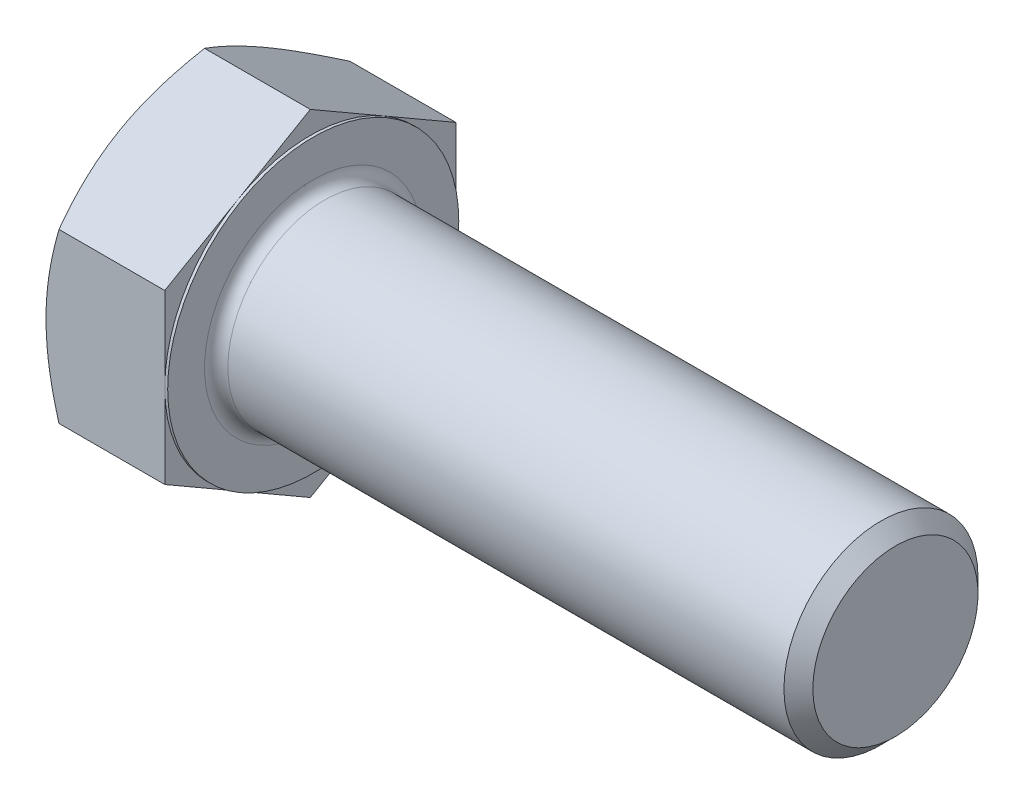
ISO-10303-21;
HEADER;
FILE_DESCRIPTION(('STEP AP214'),'2;1');
FILE_NAME('part.step','',(''),(''),'','','');
FILE_SCHEMA(('AUTOMOTIVE_DESIGN { 1 0 10303 214 1 1 1 1 }'));
ENDSEC;
DATA;
#1=APPLICATION_CONTEXT('core data for automotive mechanical design processes');
#2=APPLICATION_PROTOCOL_DEFINITION('international standard','automotive_design',2000,#1);
#3=PRODUCT_CONTEXT('',#1,'mechanical');
#4=PRODUCT('Part','Part','',(#3));
#5=PRODUCT_RELATED_PRODUCT_CATEGORY('part','',(#4));
#6=PRODUCT_DEFINITION_FORMATION('','',#4);
#7=PRODUCT_DEFINITION_CONTEXT('part definition',#1,'design');
#8=PRODUCT_DEFINITION('design','',#6,#7);
#9=PRODUCT_DEFINITION_SHAPE('','',#8);
#10=(LENGTH_UNIT() NAMED_UNIT(*) SI_UNIT(.MILLI.,.METRE.));
#11=(NAMED_UNIT(*) PLANE_ANGLE_UNIT() SI_UNIT($,.RADIAN.));
#12=(NAMED_UNIT(*) SI_UNIT($,.STERADIAN.) SOLID_ANGLE_UNIT());
#13=UNCERTAINTY_MEASURE_WITH_UNIT(LENGTH_MEASURE(1.E-05),#10,'distance_accuracy_value','');
#14=(GEOMETRIC_REPRESENTATION_CONTEXT(3) GLOBAL_UNCERTAINTY_ASSIGNED_CONTEXT((#13)) GLOBAL_UNIT_ASSIGNED_CONTEXT((#10,
#11,#12)) REPRESENTATION_CONTEXT('',''));
#15=CARTESIAN_POINT('',(0.,0.,0.));
#16=DIRECTION('',(0.,0.,1.));
#17=DIRECTION('',(1.,0.,0.));
#18=AXIS2_PLACEMENT_3D('',#15,#16,#17);
#19=CARTESIAN_POINT('',(15.9258,21.9970452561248,0.));
#20=DIRECTION('',(1.,0.,0.));
#21=DIRECTION('',(0.,0.,-1.));
#22=AXIS2_PLACEMENT_3D('',#19,#20,#21);
#23=PLANE('',#22);
#24=CARTESIAN_POINT('',(15.9258,0.,0.));
#25=DIRECTION('',(1.,0.,0.));
#26=DIRECTION('',(0.,0.,-1.));
#27=AXIS2_PLACEMENT_3D('',#24,#25,#26);
#28=CIRCLE('',#27,14.224);
#29=CARTESIAN_POINT('',(15.9258,0.,-14.224));
#30=VERTEX_POINT('',#29);
#31=EDGE_CURVE('E41',#30,#30,#28,.F.);
#32=ORIENTED_EDGE('',*,*,#31,.T.);
#33=EDGE_LOOP('',(#32));
#34=FACE_BOUND('',#33,.T.);
#35=CARTESIAN_POINT('',(15.9258,0.,0.));
#36=DIRECTION('',(1.,0.,0.));
#37=DIRECTION('',(0.,0.,-1.));
#38=AXIS2_PLACEMENT_3D('',#35,#36,#37);
#39=CIRCLE('',#38,19.05);
#40=CARTESIAN_POINT('',(15.9258,0.,-19.05));
#41=VERTEX_POINT('',#40);
#42=EDGE_CURVE('E298',#41,#41,#39,.T.);
#43=ORIENTED_EDGE('',*,*,#42,.T.);
#44=EDGE_LOOP('',(#43));
#45=FACE_BOUND('',#44,.T.);
#46=ADVANCED_FACE('F33',(#34,#45),#23,.T.);
#47=CARTESIAN_POINT('',(0.,0.,0.));
#48=DIRECTION('',(-1.,0.,0.));
#49=DIRECTION('',(0.,0.,1.));
#50=AXIS2_PLACEMENT_3D('',#47,#48,#49);
#51=CYLINDRICAL_SURFACE('',#50,12.7);
#52=CARTESIAN_POINT('',(17.4498,0.,0.));
#53=DIRECTION('',(1.,0.,0.));
#54=DIRECTION('',(0.,0.,-1.));
#55=AXIS2_PLACEMENT_3D('',#52,#53,#54);
#56=CIRCLE('',#55,12.7);
#57=CARTESIAN_POINT('',(17.4498,0.,-12.7));
#58=VERTEX_POINT('',#57);
#59=EDGE_CURVE('E11',#58,#58,#56,.T.);
#60=ORIENTED_EDGE('',*,*,#59,.T.);
#61=EDGE_LOOP('',(#60));
#62=FACE_BOUND('',#61,.T.);
#63=CARTESIAN_POINT('',(90.2335,0.,0.));
#64=DIRECTION('',(-1.,0.,0.));
#65=DIRECTION('',(0.,0.,1.));
#66=AXIS2_PLACEMENT_3D('',#63,#64,#65);
#67=CIRCLE('',#66,12.7);
#68=CARTESIAN_POINT('',(90.2335,0.,12.7));
#69=VERTEX_POINT('',#68);
#70=EDGE_CURVE('E277',#69,#69,#67,.T.);
#71=ORIENTED_EDGE('',*,*,#70,.T.);
#72=EDGE_LOOP('',(#71));
#73=FACE_BOUND('',#72,.T.);
#74=ADVANCED_FACE('F251',(#62,#73),#51,.T.);
#75=CARTESIAN_POINT('',(92.1258,0.,0.));
#76=DIRECTION('',(-1.,0.,0.));
#77=DIRECTION('',(0.,0.,1.));
#78=AXIS2_PLACEMENT_3D('',#75,#76,#77);
#79=CONICAL_SURFACE('',#78,10.8077,0.785398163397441);
#80=ORIENTED_EDGE('',*,*,#70,.F.);
#81=EDGE_LOOP('',(#80));
#82=FACE_BOUND('',#81,.T.);
#83=CARTESIAN_POINT('',(92.1258,0.,0.));
#84=DIRECTION('',(-1.,0.,0.));
#85=DIRECTION('',(0.,0.,1.));
#86=AXIS2_PLACEMENT_3D('',#83,#84,#85);
#87=CIRCLE('',#86,10.8077);
#88=CARTESIAN_POINT('',(92.1258,0.,10.8077));
#89=VERTEX_POINT('',#88);
#90=EDGE_CURVE('E275',#89,#89,#87,.T.);
#91=ORIENTED_EDGE('',*,*,#90,.T.);
#92=EDGE_LOOP('',(#91));
#93=FACE_BOUND('',#92,.T.);
#94=ADVANCED_FACE('F256',(#82,#93),#79,.T.);
#95=CARTESIAN_POINT('',(92.1258,0.,0.));
#96=DIRECTION('',(-1.,0.,0.));
#97=DIRECTION('',(0.,0.,1.));
#98=AXIS2_PLACEMENT_3D('',#95,#96,#97);
#99=PLANE('',#98);
#100=ORIENTED_EDGE('',*,*,#90,.F.);
#101=EDGE_LOOP('',(#100));
#102=FACE_BOUND('',#101,.T.);
#103=ADVANCED_FACE('F263',(#102),#99,.F.);
#104=CARTESIAN_POINT('',(15.5448,19.05,0.));
#105=DIRECTION('',(1.,0.,0.));
#106=DIRECTION('',(0.,0.,-1.));
#107=AXIS2_PLACEMENT_3D('',#104,#105,#106);
#108=PLANE('',#107);
#109=DIRECTION('',(0.,0.500000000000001,0.866025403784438));
#110=VECTOR('',#109,1.);
#111=CARTESIAN_POINT('',(15.5448,10.9985226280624,-19.05));
#112=LINE('',#111,#110);
#113=CARTESIAN_POINT('',(15.5448,10.9985226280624,-19.05));
#114=VERTEX_POINT('',#113);
#115=CARTESIAN_POINT('',(15.5448,16.4977839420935,-9.52500000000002));
#116=VERTEX_POINT('',#115);
#117=EDGE_CURVE('E165',#114,#116,#112,.T.);
#118=ORIENTED_EDGE('',*,*,#117,.T.);
#119=CARTESIAN_POINT('',(15.5448,0.,0.));
#120=DIRECTION('',(-1.,0.,0.));
#121=DIRECTION('',(0.,0.,1.));
#122=AXIS2_PLACEMENT_3D('',#119,#120,#121);
#123=CIRCLE('',#122,19.05);
#124=CARTESIAN_POINT('',(15.5448,0.,-19.05));
#125=VERTEX_POINT('',#124);
#126=EDGE_CURVE('E48',#116,#125,#123,.T.);
#127=ORIENTED_EDGE('',*,*,#126,.T.);
#128=DIRECTION('',(0.,1.,0.));
#129=VECTOR('',#128,1.);
#130=CARTESIAN_POINT('',(15.5448,10.9985226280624,-19.05));
#131=LINE('',#130,#129);
#132=EDGE_CURVE('E301',#125,#114,#131,.T.);
#133=ORIENTED_EDGE('',*,*,#132,.T.);
#134=EDGE_LOOP('',(#118,#127,#133));
#135=FACE_BOUND('',#134,.T.);
#136=ADVANCED_FACE('F266',(#135),#108,.T.);
#137=CARTESIAN_POINT('',(15.5448,21.9970452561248,0.));
#138=VERTEX_POINT('',#137);
#139=EDGE_CURVE('E163',#116,#138,#112,.T.);
#140=ORIENTED_EDGE('',*,*,#139,.T.);
#141=DIRECTION('',(0.,-0.500000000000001,0.866025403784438));
#142=VECTOR('',#141,1.);
#143=CARTESIAN_POINT('',(15.5448,21.9970452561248,0.));
#144=LINE('',#143,#142);
#145=CARTESIAN_POINT('',(15.5448,16.4977839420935,9.52500000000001));
#146=VERTEX_POINT('',#145);
#147=EDGE_CURVE('E162',#138,#146,#144,.T.);
#148=ORIENTED_EDGE('',*,*,#147,.T.);
#149=EDGE_CURVE('E151',#146,#116,#123,.T.);
#150=ORIENTED_EDGE('',*,*,#149,.T.);
#151=EDGE_LOOP('',(#140,#148,#150));
#152=FACE_BOUND('',#151,.T.);
#153=ADVANCED_FACE('F271',(#152),#108,.T.);
#154=CARTESIAN_POINT('',(15.5448,10.9985226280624,19.05));
#155=VERTEX_POINT('',#154);
#156=EDGE_CURVE('E130',#146,#155,#144,.T.);
#157=ORIENTED_EDGE('',*,*,#156,.T.);
#158=DIRECTION('',(0.,-1.,0.));
#159=VECTOR('',#158,1.);
#160=CARTESIAN_POINT('',(15.5448,10.9985226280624,19.05));
#161=LINE('',#160,#159);
#162=CARTESIAN_POINT('',(15.5448,0.,19.05));
#163=VERTEX_POINT('',#162);
#164=EDGE_CURVE('E124',#155,#163,#161,.T.);
#165=ORIENTED_EDGE('',*,*,#164,.T.);
#166=EDGE_CURVE('E128',#163,#146,#123,.T.);
#167=ORIENTED_EDGE('',*,*,#166,.T.);
#168=EDGE_LOOP('',(#157,#165,#167));
#169=FACE_BOUND('',#168,.T.);
#170=ADVANCED_FACE('F126',(#169),#108,.T.);
#171=CARTESIAN_POINT('',(15.5448,-10.9985226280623,19.05));
#172=VERTEX_POINT('',#171);
#173=EDGE_CURVE('E134',#163,#172,#161,.T.);
#174=ORIENTED_EDGE('',*,*,#173,.T.);
#175=DIRECTION('',(0.,-0.500000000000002,-0.866025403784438));
#176=VECTOR('',#175,1.);
#177=CARTESIAN_POINT('',(15.5448,-21.9970452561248,0.));
#178=LINE('',#177,#176);
#179=CARTESIAN_POINT('',(15.5448,-16.4977839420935,9.52500000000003));
#180=VERTEX_POINT('',#179);
#181=EDGE_CURVE('E141',#172,#180,#178,.T.);
#182=ORIENTED_EDGE('',*,*,#181,.T.);
#183=EDGE_CURVE('E138',#180,#163,#123,.T.);
#184=ORIENTED_EDGE('',*,*,#183,.T.);
#185=EDGE_LOOP('',(#174,#182,#184));
#186=FACE_BOUND('',#185,.T.);
#187=ADVANCED_FACE('F139',(#186),#108,.T.);
#188=CARTESIAN_POINT('',(15.5448,-21.9970452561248,0.));
#189=VERTEX_POINT('',#188);
#190=EDGE_CURVE('E157',#180,#189,#178,.T.);
#191=ORIENTED_EDGE('',*,*,#190,.T.);
#192=DIRECTION('',(0.,0.5,-0.866025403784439));
#193=VECTOR('',#192,1.);
#194=CARTESIAN_POINT('',(15.5448,-10.9985226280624,-19.05));
#195=LINE('',#194,#193);
#196=CARTESIAN_POINT('',(15.5448,-16.4977839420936,-9.525));
#197=VERTEX_POINT('',#196);
#198=EDGE_CURVE('E339',#189,#197,#195,.T.);
#199=ORIENTED_EDGE('',*,*,#198,.T.);
#200=EDGE_CURVE('E145',#197,#180,#123,.T.);
#201=ORIENTED_EDGE('',*,*,#200,.T.);
#202=EDGE_LOOP('',(#191,#199,#201));
#203=FACE_BOUND('',#202,.T.);
#204=ADVANCED_FACE('F340',(#203),#108,.T.);
#205=CARTESIAN_POINT('',(15.5448,-10.9985226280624,-19.05));
#206=VERTEX_POINT('',#205);
#207=EDGE_CURVE('E152',#197,#206,#195,.T.);
#208=ORIENTED_EDGE('',*,*,#207,.T.);
#209=EDGE_CURVE('E302',#206,#125,#131,.T.);
#210=ORIENTED_EDGE('',*,*,#209,.T.);
#211=EDGE_CURVE('E309',#125,#197,#123,.T.);
#212=ORIENTED_EDGE('',*,*,#211,.T.);
#213=EDGE_LOOP('',(#208,#210,#212));
#214=FACE_BOUND('',#213,.T.);
#215=ADVANCED_FACE('F272',(#214),#108,.T.);
#216=CARTESIAN_POINT('',(0.,0.,0.));
#217=DIRECTION('',(-1.,0.,0.));
#218=DIRECTION('',(0.,0.,1.));
#219=AXIS2_PLACEMENT_3D('',#216,#217,#218);
#220=CYLINDRICAL_SURFACE('',#219,19.05);
#221=ORIENTED_EDGE('',*,*,#126,.F.);
#222=ORIENTED_EDGE('',*,*,#149,.F.);
#223=ORIENTED_EDGE('',*,*,#166,.F.);
#224=ORIENTED_EDGE('',*,*,#183,.F.);
#225=ORIENTED_EDGE('',*,*,#200,.F.);
#226=ORIENTED_EDGE('',*,*,#211,.F.);
#227=EDGE_LOOP('',(#221,#222,#223,#224,#225,#226));
#228=FACE_BOUND('',#227,.T.);
#229=ORIENTED_EDGE('',*,*,#42,.F.);
#230=EDGE_LOOP('',(#229));
#231=FACE_BOUND('',#230,.T.);
#232=ADVANCED_FACE('F148',(#228,#231),#220,.T.);
#233=CARTESIAN_POINT('',(0.,21.9970452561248,0.));
#234=DIRECTION('',(1.,0.,0.));
#235=DIRECTION('',(0.,0.,-1.));
#236=AXIS2_PLACEMENT_3D('',#233,#234,#235);
#237=PLANE('',#236);
#238=CARTESIAN_POINT('',(0.,0.,0.));
#239=DIRECTION('',(1.,0.,0.));
#240=DIRECTION('',(0.,0.,-1.));
#241=AXIS2_PLACEMENT_3D('',#238,#239,#240);
#242=CIRCLE('',#241,19.05);
#243=CARTESIAN_POINT('',(0.,0.,-19.05));
#244=VERTEX_POINT('',#243);
#245=CARTESIAN_POINT('',(0.,16.4977839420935,-9.52500000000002));
#246=VERTEX_POINT('',#245);
#247=EDGE_CURVE('E297',#244,#246,#242,.T.);
#248=ORIENTED_EDGE('',*,*,#247,.F.);
#249=CARTESIAN_POINT('',(0.,-16.4977839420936,-9.525));
#250=VERTEX_POINT('',#249);
#251=EDGE_CURVE('E293',#250,#244,#242,.T.);
#252=ORIENTED_EDGE('',*,*,#251,.F.);
#253=CARTESIAN_POINT('',(0.,-16.4977839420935,9.52500000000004));
#254=VERTEX_POINT('',#253);
#255=EDGE_CURVE('E296',#254,#250,#242,.T.);
#256=ORIENTED_EDGE('',*,*,#255,.F.);
#257=CARTESIAN_POINT('',(0.,0.,19.05));
#258=VERTEX_POINT('',#257);
#259=EDGE_CURVE('E332',#258,#254,#242,.T.);
#260=ORIENTED_EDGE('',*,*,#259,.F.);
#261=CARTESIAN_POINT('',(0.,0.,0.));
#262=DIRECTION('',(-1.,0.,0.));
#263=DIRECTION('',(0.,0.,1.));
#264=AXIS2_PLACEMENT_3D('',#261,#262,#263);
#265=CIRCLE('',#264,19.05);
#266=CARTESIAN_POINT('',(0.,16.4977839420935,9.52500000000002));
#267=VERTEX_POINT('',#266);
#268=EDGE_CURVE('E166',#258,#267,#265,.T.);
#269=ORIENTED_EDGE('',*,*,#268,.T.);
#270=EDGE_CURVE('E355',#246,#267,#242,.T.);
#271=ORIENTED_EDGE('',*,*,#270,.F.);
#272=EDGE_LOOP('',(#248,#252,#256,#260,#269,#271));
#273=FACE_BOUND('',#272,.T.);
#274=ADVANCED_FACE('F197',(#273),#237,.F.);
#275=CARTESIAN_POINT('',(0.,0.,0.));
#276=DIRECTION('',(1.,0.,0.));
#277=DIRECTION('',(0.,0.,-1.));
#278=AXIS2_PLACEMENT_3D('',#275,#276,#277);
#279=CONICAL_SURFACE('',#278,19.05,1.0471975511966);
#280=CARTESIAN_POINT('',(1.70154403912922,10.9984071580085,19.0502));
#281=CARTESIAN_POINT('',(1.56198341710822,11.2401500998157,18.6314889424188));
#282=CARTESIAN_POINT('',(1.42875584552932,11.4828359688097,18.2111446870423));
#283=CARTESIAN_POINT('',(1.17672716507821,11.9701537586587,17.3670855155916));
#284=CARTESIAN_POINT('',(1.05793080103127,12.2147862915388,16.9433695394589));
#285=CARTESIAN_POINT('',(0.836361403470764,12.7064702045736,16.0917480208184));
#286=CARTESIAN_POINT('',(0.733626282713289,12.9535258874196,15.6638350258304));
#287=CARTESIAN_POINT('',(0.546385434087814,13.4493539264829,14.8050356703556));
#288=CARTESIAN_POINT('',(0.461878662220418,13.6981261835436,14.374149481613));
#289=CARTESIAN_POINT('',(0.314688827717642,14.1910129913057,13.5204444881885));
#290=CARTESIAN_POINT('',(0.251518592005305,14.4350909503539,13.0976890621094));
#291=CARTESIAN_POINT('',(0.145596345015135,14.9243652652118,12.250241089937));
#292=CARTESIAN_POINT('',(0.102844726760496,15.1695616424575,11.8255485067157));
#293=CARTESIAN_POINT('',(0.0388391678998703,15.6603662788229,10.9754499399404));
#294=CARTESIAN_POINT('',(0.0175596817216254,15.9059736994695,10.5500454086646));
#295=CARTESIAN_POINT('',(-0.00304398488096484,16.397415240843,9.69884369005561));
#296=CARTESIAN_POINT('',(-0.00236884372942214,16.6432493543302,9.27304651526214));
#297=CARTESIAN_POINT('',(0.0194033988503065,17.1028414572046,8.47700964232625));
#298=CARTESIAN_POINT('',(0.0378455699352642,17.316632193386,8.10671322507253));
#299=CARTESIAN_POINT('',(0.0909844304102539,17.7437036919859,7.36700369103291));
#300=CARTESIAN_POINT('',(0.125680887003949,17.9569844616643,6.9975905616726));
#301=CARTESIAN_POINT('',(0.210726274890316,18.3829552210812,6.25978756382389));
#302=CARTESIAN_POINT('',(0.261089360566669,18.5956445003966,5.89139892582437));
#303=CARTESIAN_POINT('',(0.376579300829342,19.0200105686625,5.15637533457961));
#304=CARTESIAN_POINT('',(0.441706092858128,19.2316873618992,4.78974037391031));
#305=CARTESIAN_POINT('',(0.660888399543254,19.8742595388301,3.6767727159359));
#306=CARTESIAN_POINT('',(0.836799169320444,20.3032941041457,2.93366305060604));
#307=CARTESIAN_POINT('',(1.23604434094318,21.1549659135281,1.45852420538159));
#308=CARTESIAN_POINT('',(1.45928498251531,21.5776140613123,0.726476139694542));
#309=CARTESIAN_POINT('',(1.70154403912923,21.9971607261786,-0.000199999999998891));
#310=B_SPLINE_CURVE_WITH_KNOTS('',3,(#280,#281,#282,#283,#284,#285,#286,#287,#288,#289,#290,
#291,#292,#293,#294,#295,#296,#297,#298,#299,#300,#301,#302,#303,#304,#305,#306,#307,#308,#309),
.UNSPECIFIED.,.F.,.F.,(4,2,2,2,2,2,2,2,2,2,2,2,2,2,4),(0.,1.50971559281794,3.01992622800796,
4.53364959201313,6.04728623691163,7.52356313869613,8.99986845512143,10.4744153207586,
11.9489166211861,13.2325441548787,14.5161533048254,15.8009255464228,17.085692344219,
19.7118183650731,22.3327898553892),.UNSPECIFIED.);
#311=CARTESIAN_POINT('',(1.70147737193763,21.9970452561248,0.));
#312=VERTEX_POINT('',#311);
#313=EDGE_CURVE('E217',#267,#312,#310,.T.);
#314=ORIENTED_EDGE('',*,*,#313,.T.);
#315=CARTESIAN_POINT('',(1.70154403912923,21.9971607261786,0.000200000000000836));
#316=CARTESIAN_POINT('',(1.56198341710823,21.7554177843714,-0.41851105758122));
#317=CARTESIAN_POINT('',(1.42875584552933,21.5127319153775,-0.838855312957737));
#318=CARTESIAN_POINT('',(1.17672716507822,21.0254141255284,-1.68291448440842));
#319=CARTESIAN_POINT('',(1.05793080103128,20.7807815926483,-2.10663046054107));
#320=CARTESIAN_POINT('',(0.836361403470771,20.2890976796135,-2.95825197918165));
#321=CARTESIAN_POINT('',(0.733626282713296,20.0420419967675,-3.38616497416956));
#322=CARTESIAN_POINT('',(0.546385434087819,19.5462139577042,-4.24496432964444));
#323=CARTESIAN_POINT('',(0.461878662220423,19.2974417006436,-4.67585051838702));
#324=CARTESIAN_POINT('',(0.314688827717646,18.8045548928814,-5.5295555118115));
#325=CARTESIAN_POINT('',(0.251518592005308,18.5604769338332,-5.95231093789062));
#326=CARTESIAN_POINT('',(0.145596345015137,18.0712026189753,-6.79975891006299));
#327=CARTESIAN_POINT('',(0.102844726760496,17.8260062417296,-7.22445149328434));
#328=CARTESIAN_POINT('',(0.0388391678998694,17.3352016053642,-8.07455006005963));
#329=CARTESIAN_POINT('',(0.0175596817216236,17.0895941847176,-8.49995459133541));
#330=CARTESIAN_POINT('',(-0.003043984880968,16.5981526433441,-9.3511563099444));
#331=CARTESIAN_POINT('',(-0.00236884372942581,16.3523185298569,-9.77695348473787));
#332=CARTESIAN_POINT('',(0.0194033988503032,15.8927264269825,-10.5729903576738));
#333=CARTESIAN_POINT('',(0.0378455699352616,15.6789356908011,-10.9432867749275));
#334=CARTESIAN_POINT('',(0.0909844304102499,15.2518641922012,-11.6829963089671));
#335=CARTESIAN_POINT('',(0.125680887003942,15.0385834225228,-12.0524094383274));
#336=CARTESIAN_POINT('',(0.210726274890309,14.612612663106,-12.7902124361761));
#337=CARTESIAN_POINT('',(0.261089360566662,14.3999233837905,-13.1586010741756));
#338=CARTESIAN_POINT('',(0.376579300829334,13.9755573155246,-13.8936246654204));
#339=CARTESIAN_POINT('',(0.441706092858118,13.7638805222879,-14.2602596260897));
#340=CARTESIAN_POINT('',(0.660888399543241,13.121308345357,-15.3732272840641));
#341=CARTESIAN_POINT('',(0.836799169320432,12.6922737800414,-16.116336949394));
#342=CARTESIAN_POINT('',(1.23604434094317,11.840601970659,-17.5914757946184));
#343=CARTESIAN_POINT('',(1.4592849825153,11.4179538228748,-18.3235238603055));
#344=CARTESIAN_POINT('',(1.70154403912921,10.9984071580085,-19.0502));
#345=B_SPLINE_CURVE_WITH_KNOTS('',3,(#315,#316,#317,#318,#319,#320,#321,#322,#323,#324,#325,
#326,#327,#328,#329,#330,#331,#332,#333,#334,#335,#336,#337,#338,#339,#340,#341,#342,#343,#344),
.UNSPECIFIED.,.F.,.F.,(4,2,2,2,2,2,2,2,2,2,2,2,2,2,4),(0.,1.50971559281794,3.01992622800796,
4.53364959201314,6.04728623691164,7.52356313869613,8.99986845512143,10.4744153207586,
11.9489166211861,13.2325441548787,14.5161533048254,15.8009255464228,17.085692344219,
19.7118183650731,22.3327898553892),.UNSPECIFIED.);
#346=EDGE_CURVE('E56',#312,#246,#345,.T.);
#347=ORIENTED_EDGE('',*,*,#346,.T.);
#348=ORIENTED_EDGE('',*,*,#270,.T.);
#349=EDGE_LOOP('',(#314,#347,#348));
#350=FACE_BOUND('',#349,.T.);
#351=ADVANCED_FACE('F356',(#350),#279,.T.);
#352=CARTESIAN_POINT('',(9.36387045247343,-29.681284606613,19.05));
#353=CARTESIAN_POINT('',(9.16146582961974,-29.264706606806,19.05));
#354=CARTESIAN_POINT('',(8.96006010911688,-28.8476434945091,19.05));
#355=CARTESIAN_POINT('',(8.55947242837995,-28.0124458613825,19.05));
#356=CARTESIAN_POINT('',(8.36029049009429,-27.5943113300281,19.05));
#357=CARTESIAN_POINT('',(7.7663676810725,-26.3380393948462,19.05));
#358=CARTESIAN_POINT('',(7.37530881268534,-25.498154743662,19.05));
#359=CARTESIAN_POINT('',(6.60327220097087,-23.808305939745,19.05));
#360=CARTESIAN_POINT('',(6.22235974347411,-22.9583118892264,19.05));
#361=CARTESIAN_POINT('',(5.47593301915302,-21.2516124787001,19.05));
#362=CARTESIAN_POINT('',(5.11041803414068,-20.3949074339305,19.05));
#363=CARTESIAN_POINT('',(4.38719116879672,-18.6452025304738,19.05));
#364=CARTESIAN_POINT('',(4.03012757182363,-17.7519333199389,19.05));
#365=CARTESIAN_POINT('',(3.34269044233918,-15.9549889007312,19.05));
#366=CARTESIAN_POINT('',(3.01231988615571,-15.0513125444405,19.05));
#367=CARTESIAN_POINT('',(2.38684616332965,-13.2337927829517,19.05));
#368=CARTESIAN_POINT('',(2.09167277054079,-12.3199737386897,19.05));
#369=CARTESIAN_POINT('',(1.54595671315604,-10.4791413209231,19.05));
#370=CARTESIAN_POINT('',(1.29540013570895,-9.55213215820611,19.05));
#371=CARTESIAN_POINT('',(0.962715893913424,-8.15413474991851,19.05));
#372=CARTESIAN_POINT('',(0.859241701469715,-7.68819648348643,19.05));
#373=CARTESIAN_POINT('',(0.667894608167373,-6.75311076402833,19.05));
#374=CARTESIAN_POINT('',(0.580021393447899,-6.28396337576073,19.05));
#375=CARTESIAN_POINT('',(0.421420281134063,-5.34278179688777,19.05));
#376=CARTESIAN_POINT('',(0.350691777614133,-4.87074770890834,19.05));
#377=CARTESIAN_POINT('',(0.227781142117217,-3.92425443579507,19.05));
#378=CARTESIAN_POINT('',(0.175598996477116,-3.44979525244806,19.05));
#379=CARTESIAN_POINT('',(0.091484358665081,-2.50539642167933,19.05));
#380=CARTESIAN_POINT('',(0.0592932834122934,-2.03547994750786,19.05));
#381=CARTESIAN_POINT('',(0.0148196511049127,-1.09470720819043,19.05));
#382=CARTESIAN_POINT('',(0.00253675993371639,-0.623850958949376,19.05));
#383=CARTESIAN_POINT('',(-0.00182781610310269,0.317959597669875,19.05));
#384=CARTESIAN_POINT('',(0.00609054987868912,0.788913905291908,19.05));
#385=CARTESIAN_POINT('',(0.0419336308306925,1.73006593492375,19.05));
#386=CARTESIAN_POINT('',(0.0698592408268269,2.20026362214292,19.05));
#387=CARTESIAN_POINT('',(0.160085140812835,3.32615149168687,19.05));
#388=CARTESIAN_POINT('',(0.231647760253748,3.9811127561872,19.05));
#389=CARTESIAN_POINT('',(0.409728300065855,5.2862687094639,19.05));
#390=CARTESIAN_POINT('',(0.516250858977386,5.93646275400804,19.05));
#391=CARTESIAN_POINT('',(0.760462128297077,7.23143263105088,19.05));
#392=CARTESIAN_POINT('',(0.898174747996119,7.87620391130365,19.05));
#393=CARTESIAN_POINT('',(1.20055584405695,9.159324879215,19.05));
#394=CARTESIAN_POINT('',(1.36522394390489,9.79767465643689,19.05));
#395=CARTESIAN_POINT('',(1.7214113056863,11.0820581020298,19.05));
#396=CARTESIAN_POINT('',(1.91344522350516,11.7279480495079,19.05));
#397=CARTESIAN_POINT('',(2.31762854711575,13.0133672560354,19.05));
#398=CARTESIAN_POINT('',(2.52977808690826,13.6528964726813,19.05));
#399=CARTESIAN_POINT('',(2.97080026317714,14.9259053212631,19.05));
#400=CARTESIAN_POINT('',(3.19966751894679,15.5593868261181,19.05));
#401=CARTESIAN_POINT('',(3.67140574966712,16.8210826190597,19.05));
#402=CARTESIAN_POINT('',(3.91427655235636,17.4492969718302,19.05));
#403=CARTESIAN_POINT('',(4.50783243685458,18.9429543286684,19.05));
#404=CARTESIAN_POINT('',(4.86391009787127,19.8062512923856,19.05));
#405=CARTESIAN_POINT('',(5.59369975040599,21.5253820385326,19.05));
#406=CARTESIAN_POINT('',(5.96741288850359,22.3812153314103,19.05));
#407=CARTESIAN_POINT('',(6.72890710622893,24.0868250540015,19.05));
#408=CARTESIAN_POINT('',(7.11669148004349,24.9366000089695,19.05));
#409=CARTESIAN_POINT('',(7.90345923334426,26.63091294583,19.05));
#410=CARTESIAN_POINT('',(8.3024423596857,27.4754510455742,19.05));
#411=CARTESIAN_POINT('',(9.10995217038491,29.161125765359,19.05));
#412=CARTESIAN_POINT('',(9.5184891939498,30.0022574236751,19.05));
#413=CARTESIAN_POINT('',(10.3430229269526,31.6808559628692,19.05));
#414=CARTESIAN_POINT('',(10.7590196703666,32.518322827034,19.05));
#415=CARTESIAN_POINT('',(11.5971269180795,34.1900490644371,19.05));
#416=CARTESIAN_POINT('',(12.0192366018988,35.0243088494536,19.05));
#417=CARTESIAN_POINT('',(12.8686125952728,36.6901944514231,19.05));
#418=CARTESIAN_POINT('',(13.2958788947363,37.5218202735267,19.05));
#419=CARTESIAN_POINT('',(14.510917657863,39.8716762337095,19.05));
#420=CARTESIAN_POINT('',(15.3037675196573,41.3872809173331,19.05));
#421=CARTESIAN_POINT('',(16.9002701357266,44.4128482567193,19.05));
#422=CARTESIAN_POINT('',(17.7039232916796,45.9228107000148,19.05));
#423=CARTESIAN_POINT('',(19.3174048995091,48.9344252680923,19.05));
#424=CARTESIAN_POINT('',(20.1272121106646,50.4360887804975,19.05));
#425=CARTESIAN_POINT('',(21.3467150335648,52.6859282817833,19.05));
#426=CARTESIAN_POINT('',(21.7540032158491,53.4354111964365,19.05));
#427=CARTESIAN_POINT('',(22.5700166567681,54.9335928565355,19.05));
#428=CARTESIAN_POINT('',(22.9787419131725,55.6822916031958,19.05));
#429=CARTESIAN_POINT('',(23.3881024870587,56.4306429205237,19.05));
#430=B_SPLINE_CURVE_WITH_KNOTS('',3,(#352,#353,#354,#355,#356,#357,#358,#359,#360,#361,#362,
#363,#364,#365,#366,#367,#368,#369,#370,#371,#372,#373,#374,#375,#376,#377,#378,#379,#380,#381,
#382,#383,#384,#385,#386,#387,#388,#389,#390,#391,#392,#393,#394,#395,#396,#397,#398,#399,#400,
#401,#402,#403,#404,#405,#406,#407,#408,#409,#410,#411,#412,#413,#414,#415,#416,#417,#418,#419,
#420,#421,#422,#423,#424,#425,#426,#427,#428,#429),.UNSPECIFIED.,.F.,.F.,(4,2,2,2,2,2,2,2,2,2,2,
2,2,2,2,2,2,2,2,2,2,2,2,2,2,2,2,2,2,2,2,2,2,2,2,2,2,2,4),(0.,1.38943761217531,2.77888892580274,
5.55819563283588,8.35240254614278,11.1464789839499,14.0321224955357,16.9180873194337,
19.7981940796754,22.6774011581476,24.1090510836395,25.5406722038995,26.9722427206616,
28.4038121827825,29.8164561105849,31.2290763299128,32.6417001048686,34.0543870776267,
36.0298747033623,38.0056245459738,39.9828940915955,41.9601360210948,43.9812438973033,
46.0023652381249,48.0228389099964,50.0432877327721,52.8445655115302,55.6460256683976,
58.4481459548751,61.2502029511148,64.0554471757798,66.8607041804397,69.665588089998,
72.4704665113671,77.6017760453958,82.7332768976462,87.8515588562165,90.4105564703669,
92.9695501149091),.UNSPECIFIED.);
#431=CARTESIAN_POINT('',(1.70147737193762,10.9985226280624,19.05));
#432=VERTEX_POINT('',#431);
#433=EDGE_CURVE('E231',#258,#432,#430,.T.);
#434=ORIENTED_EDGE('',*,*,#433,.T.);
#435=EDGE_CURVE('E230',#432,#267,#310,.T.);
#436=ORIENTED_EDGE('',*,*,#435,.T.);
#437=ORIENTED_EDGE('',*,*,#268,.F.);
#438=EDGE_LOOP('',(#434,#436,#437));
#439=FACE_BOUND('',#438,.T.);
#440=ADVANCED_FACE('F326',(#439),#279,.T.);
#441=CARTESIAN_POINT('',(1.70147737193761,-10.9985226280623,19.05));
#442=VERTEX_POINT('',#441);
#443=EDGE_CURVE('E278',#442,#258,#430,.T.);
#444=ORIENTED_EDGE('',*,*,#443,.T.);
#445=ORIENTED_EDGE('',*,*,#259,.T.);
#446=CARTESIAN_POINT('',(1.70154403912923,-21.9971607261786,-0.000200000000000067));
#447=CARTESIAN_POINT('',(1.56198341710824,-21.7554177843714,0.418511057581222));
#448=CARTESIAN_POINT('',(1.42875584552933,-21.5127319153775,0.838855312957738));
#449=CARTESIAN_POINT('',(1.17672716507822,-21.0254141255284,1.68291448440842));
#450=CARTESIAN_POINT('',(1.05793080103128,-20.7807815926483,2.10663046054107));
#451=CARTESIAN_POINT('',(0.836361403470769,-20.2890976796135,2.95825197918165));
#452=CARTESIAN_POINT('',(0.733626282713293,-20.0420419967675,3.38616497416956));
#453=CARTESIAN_POINT('',(0.546385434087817,-19.5462139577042,4.24496432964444));
#454=CARTESIAN_POINT('',(0.461878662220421,-19.2974417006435,4.67585051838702));
#455=CARTESIAN_POINT('',(0.314688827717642,-18.8045548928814,5.5295555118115));
#456=CARTESIAN_POINT('',(0.251518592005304,-18.5604769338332,5.95231093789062));
#457=CARTESIAN_POINT('',(0.145596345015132,-18.0712026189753,6.79975891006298));
#458=CARTESIAN_POINT('',(0.102844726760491,-17.8260062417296,7.22445149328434));
#459=CARTESIAN_POINT('',(0.0388391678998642,-17.3352016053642,8.07455006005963));
#460=CARTESIAN_POINT('',(0.0175596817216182,-17.0895941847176,8.49995459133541));
#461=CARTESIAN_POINT('',(-0.00304398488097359,-16.5981526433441,9.35115630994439));
#462=CARTESIAN_POINT('',(-0.00236884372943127,-16.3523185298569,9.77695348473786));
#463=CARTESIAN_POINT('',(0.0194033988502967,-15.8927264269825,10.5729903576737));
#464=CARTESIAN_POINT('',(0.0378455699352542,-15.6789356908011,10.9432867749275));
#465=CARTESIAN_POINT('',(0.0909844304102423,-15.2518641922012,11.6829963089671));
#466=CARTESIAN_POINT('',(0.125680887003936,-15.0385834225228,12.0524094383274));
#467=CARTESIAN_POINT('',(0.210726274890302,-14.6126126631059,12.7902124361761));
#468=CARTESIAN_POINT('',(0.261089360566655,-14.3999233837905,13.1586010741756));
#469=CARTESIAN_POINT('',(0.376579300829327,-13.9755573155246,13.8936246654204));
#470=CARTESIAN_POINT('',(0.441706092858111,-13.7638805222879,14.2602596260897));
#471=CARTESIAN_POINT('',(0.660888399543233,-13.121308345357,15.3732272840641));
#472=CARTESIAN_POINT('',(0.836799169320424,-12.6922737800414,16.116336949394));
#473=CARTESIAN_POINT('',(1.23604434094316,-11.840601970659,17.5914757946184));
#474=CARTESIAN_POINT('',(1.45928498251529,-11.4179538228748,18.3235238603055));
#475=CARTESIAN_POINT('',(1.70154403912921,-10.9984071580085,19.0502));
#476=B_SPLINE_CURVE_WITH_KNOTS('',3,(#446,#447,#448,#449,#450,#451,#452,#453,#454,#455,#456,
#457,#458,#459,#460,#461,#462,#463,#464,#465,#466,#467,#468,#469,#470,#471,#472,#473,#474,#475),
.UNSPECIFIED.,.F.,.F.,(4,2,2,2,2,2,2,2,2,2,2,2,2,2,4),(0.,1.50971559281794,3.01992622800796,
4.53364959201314,6.04728623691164,7.52356313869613,8.99986845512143,10.4744153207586,
11.9489166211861,13.2325441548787,14.5161533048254,15.8009255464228,17.085692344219,
19.7118183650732,22.3327898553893),.UNSPECIFIED.);
#477=EDGE_CURVE('E219',#254,#442,#476,.T.);
#478=ORIENTED_EDGE('',*,*,#477,.T.);
#479=EDGE_LOOP('',(#444,#445,#478));
#480=FACE_BOUND('',#479,.T.);
#481=ADVANCED_FACE('F186',(#480),#279,.T.);
#482=CARTESIAN_POINT('',(1.70147737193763,-21.9970452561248,0.));
#483=VERTEX_POINT('',#482);
#484=EDGE_CURVE('E211',#483,#254,#476,.T.);
#485=ORIENTED_EDGE('',*,*,#484,.T.);
#486=ORIENTED_EDGE('',*,*,#255,.T.);
#487=CARTESIAN_POINT('',(1.70154403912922,-10.9984071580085,-19.0502));
#488=CARTESIAN_POINT('',(1.56198341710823,-11.2401500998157,-18.6314889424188));
#489=CARTESIAN_POINT('',(1.42875584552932,-11.4828359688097,-18.2111446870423));
#490=CARTESIAN_POINT('',(1.17672716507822,-11.9701537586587,-17.3670855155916));
#491=CARTESIAN_POINT('',(1.05793080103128,-12.2147862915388,-16.9433695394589));
#492=CARTESIAN_POINT('',(0.836361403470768,-12.7064702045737,-16.0917480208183));
#493=CARTESIAN_POINT('',(0.733626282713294,-12.9535258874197,-15.6638350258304));
#494=CARTESIAN_POINT('',(0.546385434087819,-13.449353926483,-14.8050356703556));
#495=CARTESIAN_POINT('',(0.461878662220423,-13.6981261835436,-14.374149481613));
#496=CARTESIAN_POINT('',(0.314688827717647,-14.1910129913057,-13.5204444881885));
#497=CARTESIAN_POINT('',(0.25151859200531,-14.4350909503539,-13.0976890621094));
#498=CARTESIAN_POINT('',(0.14559634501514,-14.9243652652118,-12.250241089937));
#499=CARTESIAN_POINT('',(0.102844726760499,-15.1695616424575,-11.8255485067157));
#500=CARTESIAN_POINT('',(0.0388391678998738,-15.6603662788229,-10.9754499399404));
#501=CARTESIAN_POINT('',(0.0175596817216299,-15.9059736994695,-10.5500454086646));
#502=CARTESIAN_POINT('',(-0.00304398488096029,-16.3974152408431,-9.6988436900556));
#503=CARTESIAN_POINT('',(-0.00236884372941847,-16.6432493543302,-9.27304651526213));
#504=CARTESIAN_POINT('',(0.0194033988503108,-17.1028414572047,-8.47700964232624));
#505=CARTESIAN_POINT('',(0.0378455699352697,-17.316632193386,-8.10671322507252));
#506=CARTESIAN_POINT('',(0.0909844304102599,-17.7437036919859,-7.3670036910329));
#507=CARTESIAN_POINT('',(0.125680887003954,-17.9569844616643,-6.99759056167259));
#508=CARTESIAN_POINT('',(0.210726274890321,-18.3829552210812,-6.25978756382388));
#509=CARTESIAN_POINT('',(0.261089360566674,-18.5956445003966,-5.89139892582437));
#510=CARTESIAN_POINT('',(0.376579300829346,-19.0200105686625,-5.15637533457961));
#511=CARTESIAN_POINT('',(0.441706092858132,-19.2316873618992,-4.78974037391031));
#512=CARTESIAN_POINT('',(0.660888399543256,-19.8742595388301,-3.67677271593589));
#513=CARTESIAN_POINT('',(0.836799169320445,-20.3032941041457,-2.93366305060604));
#514=CARTESIAN_POINT('',(1.23604434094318,-21.1549659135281,-1.45852420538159));
#515=CARTESIAN_POINT('',(1.45928498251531,-21.5776140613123,-0.726476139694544));
#516=CARTESIAN_POINT('',(1.70154403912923,-21.9971607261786,0.000199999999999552));
#517=B_SPLINE_CURVE_WITH_KNOTS('',3,(#487,#488,#489,#490,#491,#492,#493,#494,#495,#496,#497,
#498,#499,#500,#501,#502,#503,#504,#505,#506,#507,#508,#509,#510,#511,#512,#513,#514,#515,#516),
.UNSPECIFIED.,.F.,.F.,(4,2,2,2,2,2,2,2,2,2,2,2,2,2,4),(0.,1.50971559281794,3.01992622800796,
4.53364959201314,6.04728623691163,7.52356313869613,8.99986845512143,10.4744153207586,
11.9489166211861,13.2325441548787,14.5161533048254,15.8009255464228,17.085692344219,
19.7118183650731,22.3327898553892),.UNSPECIFIED.);
#518=EDGE_CURVE('E218',#250,#483,#517,.T.);
#519=ORIENTED_EDGE('',*,*,#518,.T.);
#520=EDGE_LOOP('',(#485,#486,#519));
#521=FACE_BOUND('',#520,.T.);
#522=ADVANCED_FACE('F354',(#521),#279,.T.);
#523=CARTESIAN_POINT('',(1.70147737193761,10.9985226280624,-19.05));
#524=VERTEX_POINT('',#523);
#525=EDGE_CURVE('E220',#246,#524,#345,.T.);
#526=ORIENTED_EDGE('',*,*,#525,.T.);
#527=CARTESIAN_POINT('',(9.36387045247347,-29.6812846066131,-19.05));
#528=CARTESIAN_POINT('',(9.16146582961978,-29.264706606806,-19.05));
#529=CARTESIAN_POINT('',(8.96006010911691,-28.8476434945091,-19.05));
#530=CARTESIAN_POINT('',(8.55947242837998,-28.0124458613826,-19.05));
#531=CARTESIAN_POINT('',(8.36029049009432,-27.5943113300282,-19.05));
#532=CARTESIAN_POINT('',(7.76636768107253,-26.3380393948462,-19.05));
#533=CARTESIAN_POINT('',(7.37530881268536,-25.498154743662,-19.05));
#534=CARTESIAN_POINT('',(6.6032722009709,-23.8083059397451,-19.05));
#535=CARTESIAN_POINT('',(6.22235974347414,-22.9583118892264,-19.05));
#536=CARTESIAN_POINT('',(5.47593301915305,-21.2516124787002,-19.05));
#537=CARTESIAN_POINT('',(5.11041803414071,-20.3949074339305,-19.05));
#538=CARTESIAN_POINT('',(4.38719116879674,-18.6452025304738,-19.05));
#539=CARTESIAN_POINT('',(4.03012757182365,-17.751933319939,-19.05));
#540=CARTESIAN_POINT('',(3.3426904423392,-15.9549889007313,-19.05));
#541=CARTESIAN_POINT('',(3.01231988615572,-15.0513125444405,-19.05));
#542=CARTESIAN_POINT('',(2.38684616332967,-13.2337927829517,-19.05));
#543=CARTESIAN_POINT('',(2.09167277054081,-12.3199737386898,-19.05));
#544=CARTESIAN_POINT('',(1.54595671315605,-10.4791413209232,-19.05));
#545=CARTESIAN_POINT('',(1.29540013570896,-9.55213215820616,-19.05));
#546=CARTESIAN_POINT('',(0.962715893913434,-8.15413474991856,-19.05));
#547=CARTESIAN_POINT('',(0.859241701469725,-7.68819648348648,-19.05));
#548=CARTESIAN_POINT('',(0.667894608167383,-6.75311076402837,-19.05));
#549=CARTESIAN_POINT('',(0.580021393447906,-6.28396337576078,-19.05));
#550=CARTESIAN_POINT('',(0.421420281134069,-5.34278179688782,-19.05));
#551=CARTESIAN_POINT('',(0.350691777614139,-4.87074770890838,-19.05));
#552=CARTESIAN_POINT('',(0.227781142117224,-3.92425443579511,-19.05));
#553=CARTESIAN_POINT('',(0.175598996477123,-3.44979525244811,-19.05));
#554=CARTESIAN_POINT('',(0.0914843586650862,-2.50539642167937,-19.05));
#555=CARTESIAN_POINT('',(0.0592932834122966,-2.03547994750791,-19.05));
#556=CARTESIAN_POINT('',(0.0148196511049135,-1.09470720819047,-19.05));
#557=CARTESIAN_POINT('',(0.00253675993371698,-0.623850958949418,-19.05));
#558=CARTESIAN_POINT('',(-0.00182781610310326,0.317959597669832,-19.05));
#559=CARTESIAN_POINT('',(0.00609054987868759,0.788913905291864,-19.05));
#560=CARTESIAN_POINT('',(0.0419336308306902,1.73006593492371,-19.05));
#561=CARTESIAN_POINT('',(0.069859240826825,2.20026362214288,-19.05));
#562=CARTESIAN_POINT('',(0.160085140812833,3.32615149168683,-19.05));
#563=CARTESIAN_POINT('',(0.231647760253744,3.98111275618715,-19.05));
#564=CARTESIAN_POINT('',(0.409728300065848,5.28626870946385,-19.05));
#565=CARTESIAN_POINT('',(0.516250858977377,5.93646275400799,-19.05));
#566=CARTESIAN_POINT('',(0.760462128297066,7.23143263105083,-19.05));
#567=CARTESIAN_POINT('',(0.898174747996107,7.87620391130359,-19.05));
#568=CARTESIAN_POINT('',(1.20055584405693,9.15932487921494,-19.05));
#569=CARTESIAN_POINT('',(1.36522394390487,9.79767465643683,-19.05));
#570=CARTESIAN_POINT('',(1.72141130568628,11.0820581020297,-19.05));
#571=CARTESIAN_POINT('',(1.91344522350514,11.7279480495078,-19.05));
#572=CARTESIAN_POINT('',(2.31762854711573,13.0133672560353,-19.05));
#573=CARTESIAN_POINT('',(2.52977808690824,13.6528964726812,-19.05));
#574=CARTESIAN_POINT('',(2.97080026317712,14.9259053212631,-19.05));
#575=CARTESIAN_POINT('',(3.19966751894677,15.5593868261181,-19.05));
#576=CARTESIAN_POINT('',(3.6714057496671,16.8210826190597,-19.05));
#577=CARTESIAN_POINT('',(3.91427655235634,17.4492969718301,-19.05));
#578=CARTESIAN_POINT('',(4.50783243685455,18.9429543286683,-19.05));
#579=CARTESIAN_POINT('',(4.86391009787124,19.8062512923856,-19.05));
#580=CARTESIAN_POINT('',(5.59369975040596,21.5253820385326,-19.05));
#581=CARTESIAN_POINT('',(5.96741288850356,22.3812153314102,-19.05));
#582=CARTESIAN_POINT('',(6.72890710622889,24.0868250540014,-19.05));
#583=CARTESIAN_POINT('',(7.11669148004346,24.9366000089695,-19.05));
#584=CARTESIAN_POINT('',(7.90345923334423,26.63091294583,-19.05));
#585=CARTESIAN_POINT('',(8.30244235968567,27.4754510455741,-19.05));
#586=CARTESIAN_POINT('',(9.10995217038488,29.161125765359,-19.05));
#587=CARTESIAN_POINT('',(9.51848919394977,30.0022574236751,-19.05));
#588=CARTESIAN_POINT('',(10.3430229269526,31.6808559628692,-19.05));
#589=CARTESIAN_POINT('',(10.7590196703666,32.5183228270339,-19.05));
#590=CARTESIAN_POINT('',(11.5971269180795,34.1900490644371,-19.05));
#591=CARTESIAN_POINT('',(12.0192366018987,35.0243088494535,-19.05));
#592=CARTESIAN_POINT('',(12.8686125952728,36.690194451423,-19.05));
#593=CARTESIAN_POINT('',(13.2958788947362,37.5218202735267,-19.05));
#594=CARTESIAN_POINT('',(14.510917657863,39.8716762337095,-19.05));
#595=CARTESIAN_POINT('',(15.3037675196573,41.3872809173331,-19.05));
#596=CARTESIAN_POINT('',(16.9002701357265,44.4128482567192,-19.05));
#597=CARTESIAN_POINT('',(17.7039232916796,45.9228107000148,-19.05));
#598=CARTESIAN_POINT('',(19.3174048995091,48.9344252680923,-19.05));
#599=CARTESIAN_POINT('',(20.1272121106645,50.4360887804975,-19.05));
#600=CARTESIAN_POINT('',(21.3467150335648,52.6859282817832,-19.05));
#601=CARTESIAN_POINT('',(21.7540032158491,53.4354111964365,-19.05));
#602=CARTESIAN_POINT('',(22.5700166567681,54.9335928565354,-19.05));
#603=CARTESIAN_POINT('',(22.9787419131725,55.6822916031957,-19.05));
#604=CARTESIAN_POINT('',(23.3881024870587,56.4306429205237,-19.05));
#605=B_SPLINE_CURVE_WITH_KNOTS('',3,(#527,#528,#529,#530,#531,#532,#533,#534,#535,#536,#537,
#538,#539,#540,#541,#542,#543,#544,#545,#546,#547,#548,#549,#550,#551,#552,#553,#554,#555,#556,
#557,#558,#559,#560,#561,#562,#563,#564,#565,#566,#567,#568,#569,#570,#571,#572,#573,#574,#575,
#576,#577,#578,#579,#580,#581,#582,#583,#584,#585,#586,#587,#588,#589,#590,#591,#592,#593,#594,
#595,#596,#597,#598,#599,#600,#601,#602,#603,#604),.UNSPECIFIED.,.F.,.F.,(4,2,2,2,2,2,2,2,2,2,2,
2,2,2,2,2,2,2,2,2,2,2,2,2,2,2,2,2,2,2,2,2,2,2,2,2,2,2,4),(0.,1.38943761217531,2.77888892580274,
5.55819563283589,8.3524025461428,11.1464789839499,14.0321224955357,16.9180873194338,
19.7981940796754,22.6774011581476,24.1090510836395,25.5406722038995,26.9722427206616,
28.4038121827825,29.816456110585,31.2290763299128,32.6417001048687,34.0543870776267,
36.0298747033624,38.0056245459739,39.9828940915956,41.9601360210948,43.9812438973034,
46.0023652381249,48.0228389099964,50.0432877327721,52.8445655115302,55.6460256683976,
58.4481459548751,61.2502029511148,64.0554471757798,66.8607041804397,69.6655880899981,
72.4704665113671,77.6017760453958,82.7332768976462,87.8515588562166,90.410556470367,
92.9695501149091),.UNSPECIFIED.);
#606=EDGE_CURVE('E178',#524,#244,#605,.F.);
#607=ORIENTED_EDGE('',*,*,#606,.T.);
#608=ORIENTED_EDGE('',*,*,#247,.T.);
#609=EDGE_LOOP('',(#526,#607,#608));
#610=FACE_BOUND('',#609,.T.);
#611=ADVANCED_FACE('F351',(#610),#279,.T.);
#612=CARTESIAN_POINT('',(1.70147737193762,-10.9985226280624,-19.05));
#613=VERTEX_POINT('',#612);
#614=EDGE_CURVE('E179',#613,#250,#517,.T.);
#615=ORIENTED_EDGE('',*,*,#614,.T.);
#616=ORIENTED_EDGE('',*,*,#251,.T.);
#617=EDGE_CURVE('E169',#244,#613,#605,.F.);
#618=ORIENTED_EDGE('',*,*,#617,.T.);
#619=EDGE_LOOP('',(#615,#616,#618));
#620=FACE_BOUND('',#619,.T.);
#621=ADVANCED_FACE('F195',(#620),#279,.T.);
#622=CARTESIAN_POINT('',(15.9258,10.9985226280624,-19.05));
#623=DIRECTION('',(0.,0.,1.));
#624=DIRECTION('',(1.,0.,0.));
#625=AXIS2_PLACEMENT_3D('',#622,#623,#624);
#626=PLANE('',#625);
#627=ORIENTED_EDGE('',*,*,#209,.F.);
#628=DIRECTION('',(-1.,0.,0.));
#629=VECTOR('',#628,1.);
#630=CARTESIAN_POINT('',(15.9258,-10.9985226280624,-19.05));
#631=LINE('',#630,#629);
#632=EDGE_CURVE('E284',#206,#613,#631,.T.);
#633=ORIENTED_EDGE('',*,*,#632,.T.);
#634=ORIENTED_EDGE('',*,*,#617,.F.);
#635=ORIENTED_EDGE('',*,*,#606,.F.);
#636=DIRECTION('',(-1.,0.,0.));
#637=VECTOR('',#636,1.);
#638=CARTESIAN_POINT('',(15.9258,10.9985226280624,-19.05));
#639=LINE('',#638,#637);
#640=EDGE_CURVE('E280',#114,#524,#639,.T.);
#641=ORIENTED_EDGE('',*,*,#640,.F.);
#642=ORIENTED_EDGE('',*,*,#132,.F.);
#643=EDGE_LOOP('',(#627,#633,#634,#635,#641,#642));
#644=FACE_BOUND('',#643,.T.);
#645=ADVANCED_FACE('F190',(#644),#626,.F.);
#646=CARTESIAN_POINT('',(15.9258,-10.9985226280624,-19.05));
#647=DIRECTION('',(0.,0.866025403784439,0.5));
#648=DIRECTION('',(0.,-0.5,0.866025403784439));
#649=AXIS2_PLACEMENT_3D('',#646,#647,#648);
#650=PLANE('',#649);
#651=ORIENTED_EDGE('',*,*,#198,.F.);
#652=DIRECTION('',(-1.,0.,0.));
#653=VECTOR('',#652,1.);
#654=CARTESIAN_POINT('',(15.9258,-21.9970452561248,0.));
#655=LINE('',#654,#653);
#656=EDGE_CURVE('E286',#189,#483,#655,.T.);
#657=ORIENTED_EDGE('',*,*,#656,.T.);
#658=ORIENTED_EDGE('',*,*,#518,.F.);
#659=ORIENTED_EDGE('',*,*,#614,.F.);
#660=ORIENTED_EDGE('',*,*,#632,.F.);
#661=ORIENTED_EDGE('',*,*,#207,.F.);
#662=EDGE_LOOP('',(#651,#657,#658,#659,#660,#661));
#663=FACE_BOUND('',#662,.T.);
#664=ADVANCED_FACE('F194',(#663),#650,.F.);
#665=CARTESIAN_POINT('',(15.9258,-21.9970452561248,0.));
#666=DIRECTION('',(0.,0.866025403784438,-0.500000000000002));
#667=DIRECTION('',(0.,0.500000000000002,0.866025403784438));
#668=AXIS2_PLACEMENT_3D('',#665,#666,#667);
#669=PLANE('',#668);
#670=ORIENTED_EDGE('',*,*,#181,.F.);
#671=DIRECTION('',(-1.,0.,0.));
#672=VECTOR('',#671,1.);
#673=CARTESIAN_POINT('',(15.9258,-10.9985226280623,19.05));
#674=LINE('',#673,#672);
#675=EDGE_CURVE('E156',#172,#442,#674,.T.);
#676=ORIENTED_EDGE('',*,*,#675,.T.);
#677=ORIENTED_EDGE('',*,*,#477,.F.);
#678=ORIENTED_EDGE('',*,*,#484,.F.);
#679=ORIENTED_EDGE('',*,*,#656,.F.);
#680=ORIENTED_EDGE('',*,*,#190,.F.);
#681=EDGE_LOOP('',(#670,#676,#677,#678,#679,#680));
#682=FACE_BOUND('',#681,.T.);
#683=ADVANCED_FACE('F202',(#682),#669,.F.);
#684=CARTESIAN_POINT('',(15.9258,10.9985226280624,19.05));
#685=DIRECTION('',(0.,0.,-1.));
#686=DIRECTION('',(-1.,0.,0.));
#687=AXIS2_PLACEMENT_3D('',#684,#685,#686);
#688=PLANE('',#687);
#689=ORIENTED_EDGE('',*,*,#164,.F.);
#690=DIRECTION('',(-1.,0.,0.));
#691=VECTOR('',#690,1.);
#692=CARTESIAN_POINT('',(15.9258,10.9985226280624,19.05));
#693=LINE('',#692,#691);
#694=EDGE_CURVE('E289',#155,#432,#693,.T.);
#695=ORIENTED_EDGE('',*,*,#694,.T.);
#696=ORIENTED_EDGE('',*,*,#433,.F.);
#697=ORIENTED_EDGE('',*,*,#443,.F.);
#698=ORIENTED_EDGE('',*,*,#675,.F.);
#699=ORIENTED_EDGE('',*,*,#173,.F.);
#700=EDGE_LOOP('',(#689,#695,#696,#697,#698,#699));
#701=FACE_BOUND('',#700,.T.);
#702=ADVANCED_FACE('F154',(#701),#688,.F.);
#703=CARTESIAN_POINT('',(15.9258,21.9970452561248,0.));
#704=DIRECTION('',(0.,-0.866025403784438,-0.500000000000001));
#705=DIRECTION('',(0.,0.500000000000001,-0.866025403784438));
#706=AXIS2_PLACEMENT_3D('',#703,#704,#705);
#707=PLANE('',#706);
#708=ORIENTED_EDGE('',*,*,#147,.F.);
#709=DIRECTION('',(-1.,0.,0.));
#710=VECTOR('',#709,1.);
#711=CARTESIAN_POINT('',(15.9258,21.9970452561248,0.));
#712=LINE('',#711,#710);
#713=EDGE_CURVE('E291',#138,#312,#712,.T.);
#714=ORIENTED_EDGE('',*,*,#713,.T.);
#715=ORIENTED_EDGE('',*,*,#313,.F.);
#716=ORIENTED_EDGE('',*,*,#435,.F.);
#717=ORIENTED_EDGE('',*,*,#694,.F.);
#718=ORIENTED_EDGE('',*,*,#156,.F.);
#719=EDGE_LOOP('',(#708,#714,#715,#716,#717,#718));
#720=FACE_BOUND('',#719,.T.);
#721=ADVANCED_FACE('F237',(#720),#707,.F.);
#722=CARTESIAN_POINT('',(15.9258,10.9985226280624,-19.05));
#723=DIRECTION('',(0.,-0.866025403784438,0.500000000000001));
#724=DIRECTION('',(0.,-0.500000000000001,-0.866025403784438));
#725=AXIS2_PLACEMENT_3D('',#722,#723,#724);
#726=PLANE('',#725);
#727=ORIENTED_EDGE('',*,*,#117,.F.);
#728=ORIENTED_EDGE('',*,*,#640,.T.);
#729=ORIENTED_EDGE('',*,*,#525,.F.);
#730=ORIENTED_EDGE('',*,*,#346,.F.);
#731=ORIENTED_EDGE('',*,*,#713,.F.);
#732=ORIENTED_EDGE('',*,*,#139,.F.);
#733=EDGE_LOOP('',(#727,#728,#729,#730,#731,#732));
#734=FACE_BOUND('',#733,.T.);
#735=ADVANCED_FACE('F240',(#734),#726,.F.);
#736=CARTESIAN_POINT('',(17.4498,0.,0.));
#737=DIRECTION('',(1.,0.,0.));
#738=DIRECTION('',(0.,0.,-1.));
#739=AXIS2_PLACEMENT_3D('',#736,#737,#738);
#740=TOROIDAL_SURFACE('',#739,14.224,1.524);
#741=ORIENTED_EDGE('',*,*,#59,.F.);
#742=EDGE_LOOP('',(#741));
#743=FACE_BOUND('',#742,.T.);
#744=ORIENTED_EDGE('',*,*,#31,.F.);
#745=EDGE_LOOP('',(#744));
#746=FACE_BOUND('',#745,.T.);
#747=ADVANCED_FACE('F35',(#743,#746),#740,.F.);
#748=CLOSED_SHELL('',(#46,#74,#94,#103,#136,#153,#170,#187,#204,#215,#232,#274,#351,#440,#481,
#522,#611,#621,#645,#664,#683,#702,#721,#735,#747));
#749=MANIFOLD_SOLID_BREP('B2',#748);
#750=ADVANCED_BREP_SHAPE_REPRESENTATION('',(#18,#749),#14);
#751=SHAPE_DEFINITION_REPRESENTATION(#9,#750);
ENDSEC;
END-ISO-10303-21;
